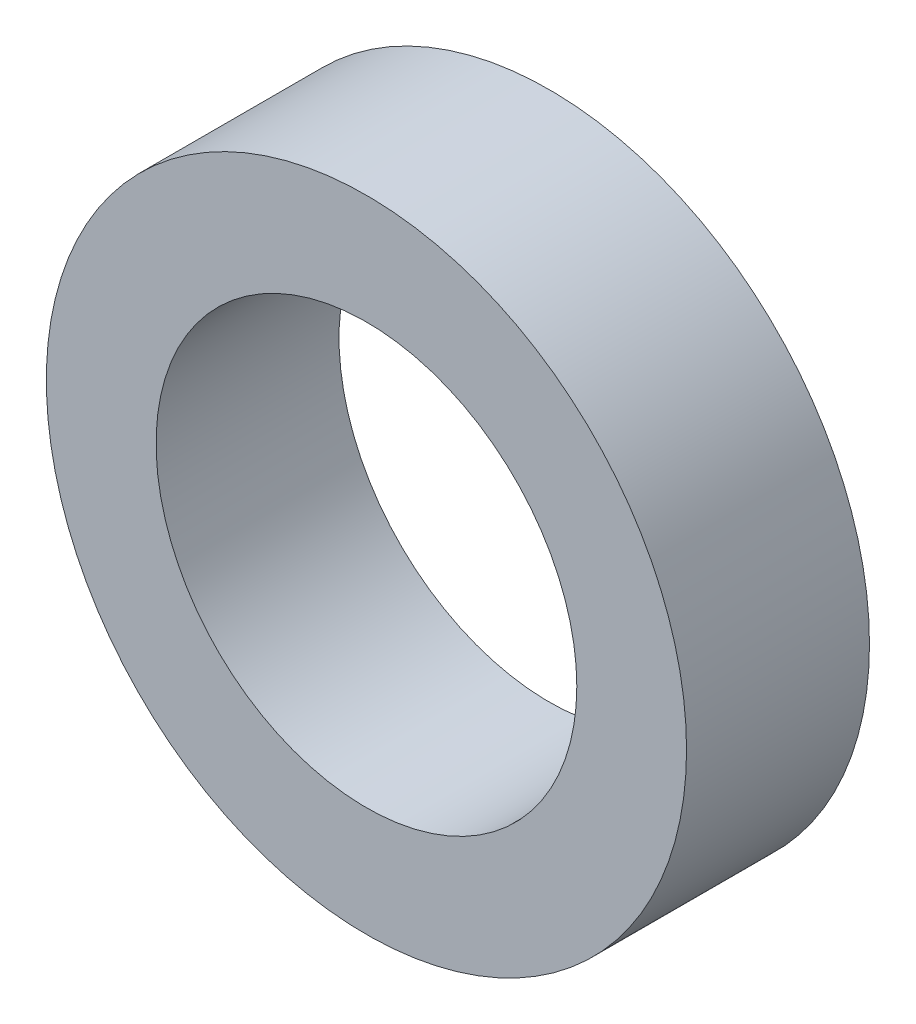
from build123d import *

# Parameters (mm, degrees)
SKETCH1_R         = 44.4499615
SKETCH1_R_2       = 29.21
BASEPIPEXXS_DEPTH = 12.7


with BuildPart() as part:
    # Sketch1 → BasePipeXXS (new, symmetric)
    with BuildSketch(Plane.XY):
        Circle(SKETCH1_R)
        Circle(SKETCH1_R_2, mode=Mode.SUBTRACT)
    extrude(amount=BASEPIPEXXS_DEPTH, both=True)


solid = part.part
